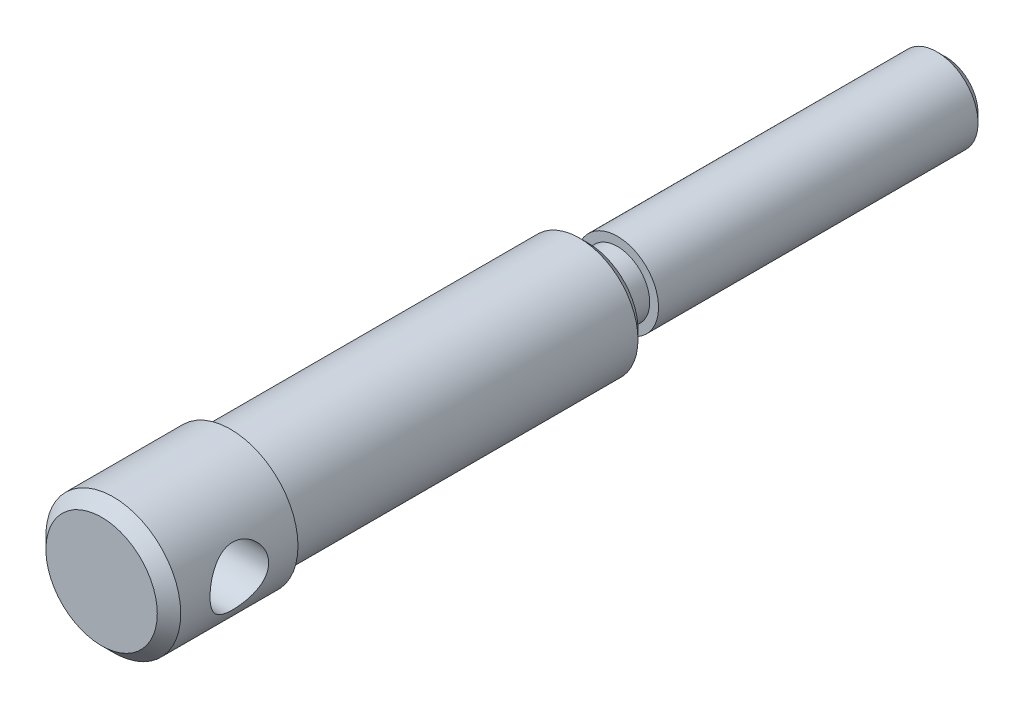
from build123d import *

# Parameters (mm, degrees)
ESQUISSE1_R             = 11.5
BASE_EXTRUSION_DEPTH    = 22
CHANFREIN3_SIZE         = 2
ESQUISSE4_R             = 10
BOSS_EXTRU_1_DEPTH      = 61
CHANFREIN1_SIZE         = 1.5
ESQUISSE5_R             = 5.5
BOSS_EXTRU_2_DEPTH      = 5
ESQUISSE6_R             = 7
BOSS_EXTRU_3_DEPTH      = 56
CHANFREIN2_SIZE         = 1.5
ESQUISSE7_R             = 5
ENL_V_MAT_EXTRU_1_DEPTH = 20


with BuildPart() as part:
    # Esquisse1 → Base-Extrusion (new body)
    with BuildSketch(Plane.XY):
        Circle(ESQUISSE1_R)
    extrude(amount=BASE_EXTRUSION_DEPTH)

    # Chanfrein3
    chanfrein3_edges = [part.edges().sort_by_distance(p)[0] for p in [
        (-11.5, 0, 22),
    ]]
    chamfer(chanfrein3_edges, length=CHANFREIN3_SIZE)

    # Esquisse4 → Boss.-Extru.1 (add)
    with BuildSketch(Plane(origin=(0, 0, 0), x_dir=(-1, 0, 0), z_dir=(0, 0, -1))):
        with Locations(Location((0, 0, 0), (0, 0, 180))):
            Circle(ESQUISSE4_R)
    extrude(amount=BOSS_EXTRU_1_DEPTH)

    # Chanfrein1
    chanfrein1_edges = [part.edges().sort_by_distance(p)[0] for p in [
        (-10, 0, -61),
    ]]
    chamfer(chanfrein1_edges, length=CHANFREIN1_SIZE)

    # Esquisse5 → Boss.-Extru.2 (add)
    with BuildSketch(Plane(origin=(0, 0, -61), x_dir=(-1, 0, 0), z_dir=(0, 0, -1))):
        Circle(ESQUISSE5_R)
    extrude(amount=BOSS_EXTRU_2_DEPTH)

    # Esquisse6 → Boss.-Extru.3 (add)
    with BuildSketch(Plane(origin=(0, 0, -66), x_dir=(-1, 0, 0), z_dir=(0, 0, -1))):
        Circle(ESQUISSE6_R)
    extrude(amount=BOSS_EXTRU_3_DEPTH)

    # Chanfrein2
    chanfrein2_edges = [part.edges().sort_by_distance(p)[0] for p in [
        (7, 0, -122),
    ]]
    chamfer(chanfrein2_edges, length=CHANFREIN2_SIZE)

    # Esquisse7 → Enl_v. mat.-Extru.1 (cut, symmetric)
    with BuildSketch(Plane(origin=(0, 0, 0), x_dir=(0, 0, -1), z_dir=(1, 0, 0))):
        with Locations(Location((-10, 0, 0), (0, 0, 180))):
            Circle(ESQUISSE7_R)
    extrude(amount=ENL_V_MAT_EXTRU_1_DEPTH, both=True, mode=Mode.SUBTRACT)


solid = part.part
